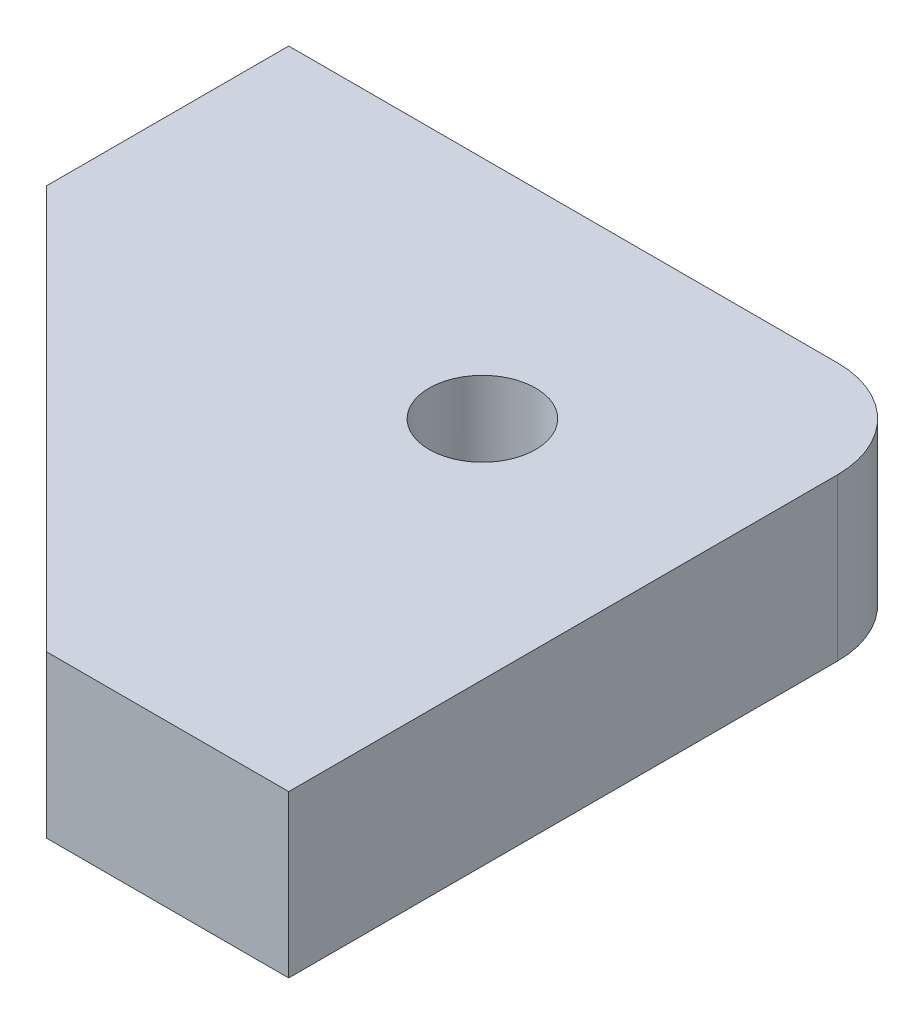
ISO-10303-21;
HEADER;
FILE_DESCRIPTION(('STEP AP214'),'2;1');
FILE_NAME('part.step','',(''),(''),'','','');
FILE_SCHEMA(('AUTOMOTIVE_DESIGN { 1 0 10303 214 1 1 1 1 }'));
ENDSEC;
DATA;
#1=APPLICATION_CONTEXT('core data for automotive mechanical design processes');
#2=APPLICATION_PROTOCOL_DEFINITION('international standard','automotive_design',2000,#1);
#3=PRODUCT_CONTEXT('',#1,'mechanical');
#4=PRODUCT('Part','Part','',(#3));
#5=PRODUCT_RELATED_PRODUCT_CATEGORY('part','',(#4));
#6=PRODUCT_DEFINITION_FORMATION('','',#4);
#7=PRODUCT_DEFINITION_CONTEXT('part definition',#1,'design');
#8=PRODUCT_DEFINITION('design','',#6,#7);
#9=PRODUCT_DEFINITION_SHAPE('','',#8);
#10=(LENGTH_UNIT() NAMED_UNIT(*) SI_UNIT(.MILLI.,.METRE.));
#11=(NAMED_UNIT(*) PLANE_ANGLE_UNIT() SI_UNIT($,.RADIAN.));
#12=(NAMED_UNIT(*) SI_UNIT($,.STERADIAN.) SOLID_ANGLE_UNIT());
#13=UNCERTAINTY_MEASURE_WITH_UNIT(LENGTH_MEASURE(1.E-05),#10,'distance_accuracy_value','');
#14=(GEOMETRIC_REPRESENTATION_CONTEXT(3) GLOBAL_UNCERTAINTY_ASSIGNED_CONTEXT((#13)) GLOBAL_UNIT_ASSIGNED_CONTEXT((#10,
#11,#12)) REPRESENTATION_CONTEXT('',''));
#15=CARTESIAN_POINT('',(0.,0.,0.));
#16=DIRECTION('',(0.,0.,1.));
#17=DIRECTION('',(1.,0.,0.));
#18=AXIS2_PLACEMENT_3D('',#15,#16,#17);
#19=CARTESIAN_POINT('',(-13.,2.5,-7.));
#20=DIRECTION('',(1.,0.,0.));
#21=DIRECTION('',(0.,0.,-1.));
#22=AXIS2_PLACEMENT_3D('',#19,#20,#21);
#23=PLANE('',#22);
#24=DIRECTION('',(0.,0.,1.));
#25=VECTOR('',#24,1.);
#26=CARTESIAN_POINT('',(-13.,-2.5,-7.));
#27=LINE('',#26,#25);
#28=CARTESIAN_POINT('',(-13.,-2.5,-7.));
#29=VERTEX_POINT('',#28);
#30=CARTESIAN_POINT('',(-13.,-2.5,0.500000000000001));
#31=VERTEX_POINT('',#30);
#32=EDGE_CURVE('E125',#29,#31,#27,.T.);
#33=ORIENTED_EDGE('',*,*,#32,.T.);
#34=DIRECTION('',(0.,-1.,0.));
#35=VECTOR('',#34,1.);
#36=CARTESIAN_POINT('',(-13.,2.5,0.500000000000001));
#37=LINE('',#36,#35);
#38=CARTESIAN_POINT('',(-13.,2.5,0.500000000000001));
#39=VERTEX_POINT('',#38);
#40=EDGE_CURVE('E11',#39,#31,#37,.T.);
#41=ORIENTED_EDGE('',*,*,#40,.F.);
#42=DIRECTION('',(0.,0.,1.));
#43=VECTOR('',#42,1.);
#44=CARTESIAN_POINT('',(-13.,2.5,-7.));
#45=LINE('',#44,#43);
#46=CARTESIAN_POINT('',(-13.,2.5,-7.));
#47=VERTEX_POINT('',#46);
#48=EDGE_CURVE('E136',#47,#39,#45,.T.);
#49=ORIENTED_EDGE('',*,*,#48,.F.);
#50=DIRECTION('',(0.,-1.,0.));
#51=VECTOR('',#50,1.);
#52=CARTESIAN_POINT('',(-13.,2.5,-7.));
#53=LINE('',#52,#51);
#54=EDGE_CURVE('E121',#47,#29,#53,.T.);
#55=ORIENTED_EDGE('',*,*,#54,.T.);
#56=EDGE_LOOP('',(#33,#41,#49,#55));
#57=FACE_BOUND('',#56,.T.);
#58=ADVANCED_FACE('F41',(#57),#23,.F.);
#59=CARTESIAN_POINT('',(-13.,2.5,0.500000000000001));
#60=DIRECTION('',(0.707106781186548,0.,-0.707106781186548));
#61=DIRECTION('',(-0.707106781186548,0.,-0.707106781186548));
#62=AXIS2_PLACEMENT_3D('',#59,#60,#61);
#63=PLANE('',#62);
#64=DIRECTION('',(0.707106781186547,0.,0.707106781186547));
#65=VECTOR('',#64,1.);
#66=CARTESIAN_POINT('',(-13.,-2.5,0.500000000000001));
#67=LINE('',#66,#65);
#68=CARTESIAN_POINT('',(-0.499999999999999,-2.5,13.));
#69=VERTEX_POINT('',#68);
#70=EDGE_CURVE('E128',#31,#69,#67,.T.);
#71=ORIENTED_EDGE('',*,*,#70,.T.);
#72=DIRECTION('',(0.,-1.,0.));
#73=VECTOR('',#72,1.);
#74=CARTESIAN_POINT('',(-0.499999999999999,2.5,13.));
#75=LINE('',#74,#73);
#76=CARTESIAN_POINT('',(-0.499999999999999,2.5,13.));
#77=VERTEX_POINT('',#76);
#78=EDGE_CURVE('E49',#77,#69,#75,.T.);
#79=ORIENTED_EDGE('',*,*,#78,.F.);
#80=DIRECTION('',(0.707106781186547,0.,0.707106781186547));
#81=VECTOR('',#80,1.);
#82=CARTESIAN_POINT('',(-13.,2.5,0.500000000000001));
#83=LINE('',#82,#81);
#84=EDGE_CURVE('E94',#39,#77,#83,.T.);
#85=ORIENTED_EDGE('',*,*,#84,.F.);
#86=ORIENTED_EDGE('',*,*,#40,.T.);
#87=EDGE_LOOP('',(#71,#79,#85,#86));
#88=FACE_BOUND('',#87,.T.);
#89=ADVANCED_FACE('F161',(#88),#63,.F.);
#90=CARTESIAN_POINT('',(-0.499999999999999,2.5,13.));
#91=DIRECTION('',(0.,0.,-1.));
#92=DIRECTION('',(-1.,0.,0.));
#93=AXIS2_PLACEMENT_3D('',#90,#91,#92);
#94=PLANE('',#93);
#95=DIRECTION('',(1.,0.,0.));
#96=VECTOR('',#95,1.);
#97=CARTESIAN_POINT('',(-0.499999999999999,-2.5,13.));
#98=LINE('',#97,#96);
#99=CARTESIAN_POINT('',(7.,-2.5,13.));
#100=VERTEX_POINT('',#99);
#101=EDGE_CURVE('E131',#69,#100,#98,.T.);
#102=ORIENTED_EDGE('',*,*,#101,.T.);
#103=DIRECTION('',(0.,-1.,0.));
#104=VECTOR('',#103,1.);
#105=CARTESIAN_POINT('',(7.,2.5,13.));
#106=LINE('',#105,#104);
#107=CARTESIAN_POINT('',(7.,2.5,13.));
#108=VERTEX_POINT('',#107);
#109=EDGE_CURVE('E116',#108,#100,#106,.T.);
#110=ORIENTED_EDGE('',*,*,#109,.F.);
#111=DIRECTION('',(1.,0.,0.));
#112=VECTOR('',#111,1.);
#113=CARTESIAN_POINT('',(-0.499999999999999,2.5,13.));
#114=LINE('',#113,#112);
#115=EDGE_CURVE('E107',#77,#108,#114,.T.);
#116=ORIENTED_EDGE('',*,*,#115,.F.);
#117=ORIENTED_EDGE('',*,*,#78,.T.);
#118=EDGE_LOOP('',(#102,#110,#116,#117));
#119=FACE_BOUND('',#118,.T.);
#120=ADVANCED_FACE('F142',(#119),#94,.F.);
#121=CARTESIAN_POINT('',(7.,2.5,13.));
#122=DIRECTION('',(-1.,0.,0.));
#123=DIRECTION('',(0.,0.,1.));
#124=AXIS2_PLACEMENT_3D('',#121,#122,#123);
#125=PLANE('',#124);
#126=DIRECTION('',(0.,0.,-1.));
#127=VECTOR('',#126,1.);
#128=CARTESIAN_POINT('',(7.,-2.5,13.));
#129=LINE('',#128,#127);
#130=CARTESIAN_POINT('',(7.,-2.5,-3.99999999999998));
#131=VERTEX_POINT('',#130);
#132=EDGE_CURVE('E115',#100,#131,#129,.T.);
#133=ORIENTED_EDGE('',*,*,#132,.T.);
#134=DIRECTION('',(0.,-1.,0.));
#135=VECTOR('',#134,1.);
#136=CARTESIAN_POINT('',(7.,2.5,-3.99999999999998));
#137=LINE('',#136,#135);
#138=CARTESIAN_POINT('',(7.,2.5,-3.99999999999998));
#139=VERTEX_POINT('',#138);
#140=EDGE_CURVE('E112',#139,#131,#137,.T.);
#141=ORIENTED_EDGE('',*,*,#140,.F.);
#142=DIRECTION('',(0.,0.,-1.));
#143=VECTOR('',#142,1.);
#144=CARTESIAN_POINT('',(7.,2.5,13.));
#145=LINE('',#144,#143);
#146=EDGE_CURVE('E101',#108,#139,#145,.T.);
#147=ORIENTED_EDGE('',*,*,#146,.F.);
#148=ORIENTED_EDGE('',*,*,#109,.T.);
#149=EDGE_LOOP('',(#133,#141,#147,#148));
#150=FACE_BOUND('',#149,.T.);
#151=ADVANCED_FACE('F113',(#150),#125,.F.);
#152=CARTESIAN_POINT('',(4.,2.5,-4.));
#153=DIRECTION('',(0.,-1.,0.));
#154=DIRECTION('',(0.,0.,-1.));
#155=AXIS2_PLACEMENT_3D('',#152,#153,#154);
#156=CYLINDRICAL_SURFACE('',#155,3.);
#157=CARTESIAN_POINT('',(4.,-2.5,-4.));
#158=DIRECTION('',(0.,1.,0.));
#159=DIRECTION('',(0.,0.,-1.));
#160=AXIS2_PLACEMENT_3D('',#157,#158,#159);
#161=CIRCLE('',#160,3.);
#162=CARTESIAN_POINT('',(3.99999999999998,-2.5,-7.));
#163=VERTEX_POINT('',#162);
#164=EDGE_CURVE('E80',#131,#163,#161,.T.);
#165=ORIENTED_EDGE('',*,*,#164,.T.);
#166=DIRECTION('',(0.,-1.,0.));
#167=VECTOR('',#166,1.);
#168=CARTESIAN_POINT('',(3.99999999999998,2.5,-7.));
#169=LINE('',#168,#167);
#170=CARTESIAN_POINT('',(3.99999999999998,2.5,-7.));
#171=VERTEX_POINT('',#170);
#172=EDGE_CURVE('E117',#171,#163,#169,.T.);
#173=ORIENTED_EDGE('',*,*,#172,.F.);
#174=CARTESIAN_POINT('',(4.,2.5,-4.));
#175=DIRECTION('',(0.,1.,0.));
#176=DIRECTION('',(0.,0.,-1.));
#177=AXIS2_PLACEMENT_3D('',#174,#175,#176);
#178=CIRCLE('',#177,3.);
#179=EDGE_CURVE('E105',#139,#171,#178,.T.);
#180=ORIENTED_EDGE('',*,*,#179,.F.);
#181=ORIENTED_EDGE('',*,*,#140,.T.);
#182=EDGE_LOOP('',(#165,#173,#180,#181));
#183=FACE_BOUND('',#182,.T.);
#184=ADVANCED_FACE('F119',(#183),#156,.T.);
#185=CARTESIAN_POINT('',(3.99999999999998,2.5,-7.));
#186=DIRECTION('',(0.,0.,1.));
#187=DIRECTION('',(1.,0.,0.));
#188=AXIS2_PLACEMENT_3D('',#185,#186,#187);
#189=PLANE('',#188);
#190=DIRECTION('',(-1.,0.,0.));
#191=VECTOR('',#190,1.);
#192=CARTESIAN_POINT('',(3.99999999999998,-2.5,-7.));
#193=LINE('',#192,#191);
#194=EDGE_CURVE('E86',#163,#29,#193,.T.);
#195=ORIENTED_EDGE('',*,*,#194,.T.);
#196=ORIENTED_EDGE('',*,*,#54,.F.);
#197=DIRECTION('',(-1.,0.,0.));
#198=VECTOR('',#197,1.);
#199=CARTESIAN_POINT('',(3.99999999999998,2.5,-7.));
#200=LINE('',#199,#198);
#201=EDGE_CURVE('E57',#171,#47,#200,.T.);
#202=ORIENTED_EDGE('',*,*,#201,.F.);
#203=ORIENTED_EDGE('',*,*,#172,.T.);
#204=EDGE_LOOP('',(#195,#196,#202,#203));
#205=FACE_BOUND('',#204,.T.);
#206=ADVANCED_FACE('F149',(#205),#189,.F.);
#207=CARTESIAN_POINT('',(4.,2.5,-4.));
#208=DIRECTION('',(0.,-1.,0.));
#209=DIRECTION('',(0.,0.,-1.));
#210=AXIS2_PLACEMENT_3D('',#207,#208,#209);
#211=PLANE('',#210);
#212=CARTESIAN_POINT('',(0.,2.5,0.));
#213=DIRECTION('',(0.,1.,0.));
#214=DIRECTION('',(0.,0.,1.));
#215=AXIS2_PLACEMENT_3D('',#212,#213,#214);
#216=CIRCLE('',#215,1.64999999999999);
#217=CARTESIAN_POINT('',(0.,2.5,1.64999999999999));
#218=VERTEX_POINT('',#217);
#219=EDGE_CURVE('E220',#218,#218,#216,.T.);
#220=ORIENTED_EDGE('',*,*,#219,.F.);
#221=EDGE_LOOP('',(#220));
#222=FACE_BOUND('',#221,.T.);
#223=ORIENTED_EDGE('',*,*,#48,.T.);
#224=ORIENTED_EDGE('',*,*,#84,.T.);
#225=ORIENTED_EDGE('',*,*,#115,.T.);
#226=ORIENTED_EDGE('',*,*,#146,.T.);
#227=ORIENTED_EDGE('',*,*,#179,.T.);
#228=ORIENTED_EDGE('',*,*,#201,.T.);
#229=EDGE_LOOP('',(#223,#224,#225,#226,#227,#228));
#230=FACE_BOUND('',#229,.T.);
#231=ADVANCED_FACE('F103',(#222,#230),#211,.F.);
#232=CARTESIAN_POINT('',(4.,-2.5,-4.));
#233=DIRECTION('',(0.,-1.,0.));
#234=DIRECTION('',(0.,0.,-1.));
#235=AXIS2_PLACEMENT_3D('',#232,#233,#234);
#236=PLANE('',#235);
#237=CARTESIAN_POINT('',(0.,-2.5,0.));
#238=DIRECTION('',(0.,-1.,0.));
#239=DIRECTION('',(0.,0.,-1.));
#240=AXIS2_PLACEMENT_3D('',#237,#238,#239);
#241=CIRCLE('',#240,1.64999999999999);
#242=CARTESIAN_POINT('',(0.,-2.5,-1.64999999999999));
#243=VERTEX_POINT('',#242);
#244=EDGE_CURVE('E129',#243,#243,#241,.T.);
#245=ORIENTED_EDGE('',*,*,#244,.F.);
#246=EDGE_LOOP('',(#245));
#247=FACE_BOUND('',#246,.T.);
#248=ORIENTED_EDGE('',*,*,#32,.F.);
#249=ORIENTED_EDGE('',*,*,#194,.F.);
#250=ORIENTED_EDGE('',*,*,#164,.F.);
#251=ORIENTED_EDGE('',*,*,#132,.F.);
#252=ORIENTED_EDGE('',*,*,#101,.F.);
#253=ORIENTED_EDGE('',*,*,#70,.F.);
#254=EDGE_LOOP('',(#248,#249,#250,#251,#252,#253));
#255=FACE_BOUND('',#254,.T.);
#256=ADVANCED_FACE('F145',(#247,#255),#236,.T.);
#257=CARTESIAN_POINT('',(0.,2.5,0.));
#258=DIRECTION('',(0.,1.,0.));
#259=DIRECTION('',(0.,0.,1.));
#260=AXIS2_PLACEMENT_3D('',#257,#258,#259);
#261=CYLINDRICAL_SURFACE('',#260,1.64999999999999);
#262=ORIENTED_EDGE('',*,*,#244,.T.);
#263=EDGE_LOOP('',(#262));
#264=FACE_BOUND('',#263,.T.);
#265=ORIENTED_EDGE('',*,*,#219,.T.);
#266=EDGE_LOOP('',(#265));
#267=FACE_BOUND('',#266,.T.);
#268=ADVANCED_FACE('F198',(#264,#267),#261,.F.);
#269=CLOSED_SHELL('',(#58,#89,#120,#151,#184,#206,#231,#256,#268));
#270=MANIFOLD_SOLID_BREP('B2',#269);
#271=ADVANCED_BREP_SHAPE_REPRESENTATION('',(#18,#270),#14);
#272=SHAPE_DEFINITION_REPRESENTATION(#9,#271);
ENDSEC;
END-ISO-10303-21;
